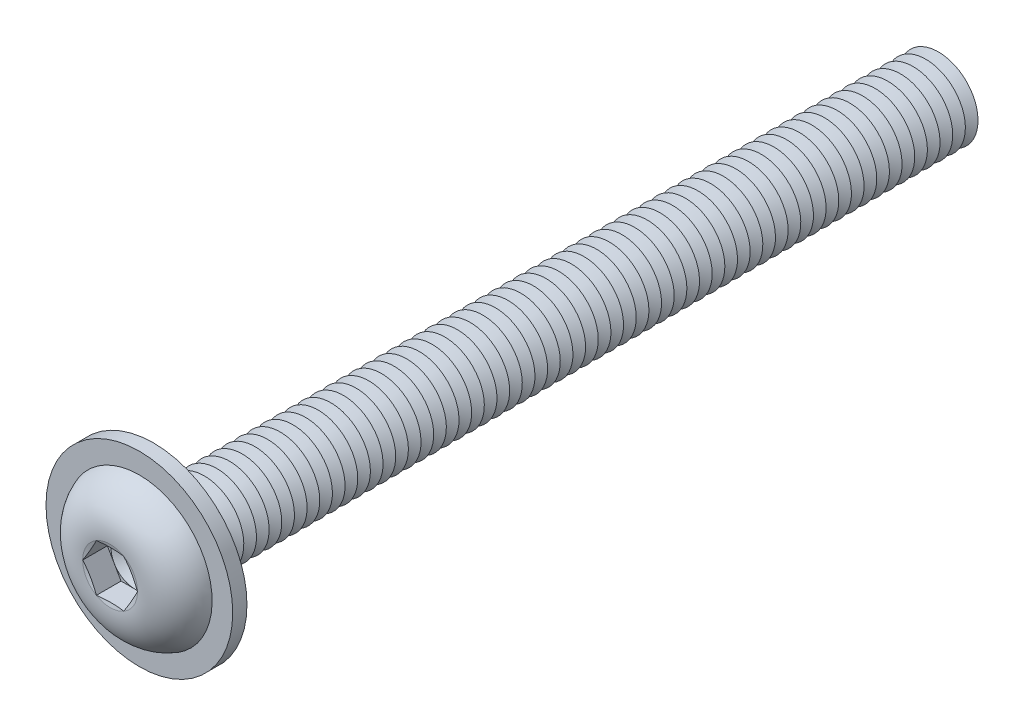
from build123d import *

# Parameters (mm, degrees)
FILLET1_R           = 0.4
LPATTERN1_COUNT     = 62
LPATTERN1_PITCH     = 0.8
CUT_EXTRUDE1_DEPTH  = 1.56
SKETCH5_R           = 5.9
SKETCH5_R_2         = 2.9
BOSS_EXTRUDE1_DEPTH = 0.9


with BuildPart() as part:
    # Sketch1 → Revolve1 (revolve)
    with BuildSketch(Plane(origin=(0, 0, 0), x_dir=(0, 0, -1), z_dir=(1, 0, 0))):
        with BuildLine():
            Line((0, 2.5), (0, 4.75))
            ThreePointArc((0, 4.75), (-2.041477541, 3.848329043), (-2.75, 1.73205))
            Line((-2.75, 1.73205), (-2.517949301, 0.866025))
            Line((-2.517949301, 0.866025), (-2.75, 0.866025))
            Line((-2.75, 0.866025), (-2.75, 0))
            Line((-2.75, 0), (50, 0))
            Line((50, 0), (50, 2.5))
            Line((50, 2.5), (0, 2.5))
        make_face()
    revolve(axis=Axis((0, 0, -50), (0, 0, 1)))

    # Fillet1
    fillet1_edges = [part.edges().sort_by_distance(p)[0] for p in [
        (0, -2.5, 0),
    ]]
    fillet(fillet1_edges, radius=FILLET1_R)

    # Sketch2 → Cut-Revolve1 (revolve, cut)
    with BuildSketch(Plane(origin=(0, 0, 0), x_dir=(0, 0, -1), z_dir=(1, 0, 0))):
        Polygon((49.6, 2.5), (50.4, 2.5), (50, 1.807179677), align=None)
    cut_revolve1 = revolve(axis=Axis((0, 0, -50), (0, 0, -1)), mode=Mode.SUBTRACT)

    # LPattern1: Cut-Revolve1 ×62
    with Locations(*[(0, 0, i * LPATTERN1_PITCH) for i in range(1, LPATTERN1_COUNT)]):
        add(cut_revolve1, mode=Mode.SUBTRACT)

    # Sketch3 → Cut-Extrude1 (cut)
    with BuildSketch(Plane.XY.offset(2.75)):
        Polygon((0.866025, 1.499999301), (-0.866025, 1.499999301), (-1.73205, 0), (-0.866025, -1.499999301), (0.866025, -1.499999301), (1.73205, 0), align=None)
    extrude(amount=-CUT_EXTRUDE1_DEPTH, mode=Mode.SUBTRACT)

    # Cut-Extrude2 cone 1 section (on through the dimple's axis) → Cut-Extrude2 (revolve, cut)
    with BuildSketch(Plane(origin=(0, 0, 1.19), x_dir=(0, -1, 0), z_dir=(1, 0, 0))):
        Polygon((0, 0), (1.499999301, 0), (0, 0.866025), align=None)
    revolve(axis=Axis((0, 0, 1.19), (0, 0, -1)), mode=Mode.SUBTRACT)

    # Sketch5 → Boss-Extrude1 (add)
    with BuildSketch(Plane(origin=(0, 0, 0), x_dir=(-1, 0, 0), z_dir=(0, 0, -1))):
        with Locations(Location((0, 0, 0), (0, 0, 90))):
            Circle(SKETCH5_R)
        Circle(SKETCH5_R_2, mode=Mode.SUBTRACT)
    extrude(amount=-BOSS_EXTRUDE1_DEPTH)


solid = part.part
